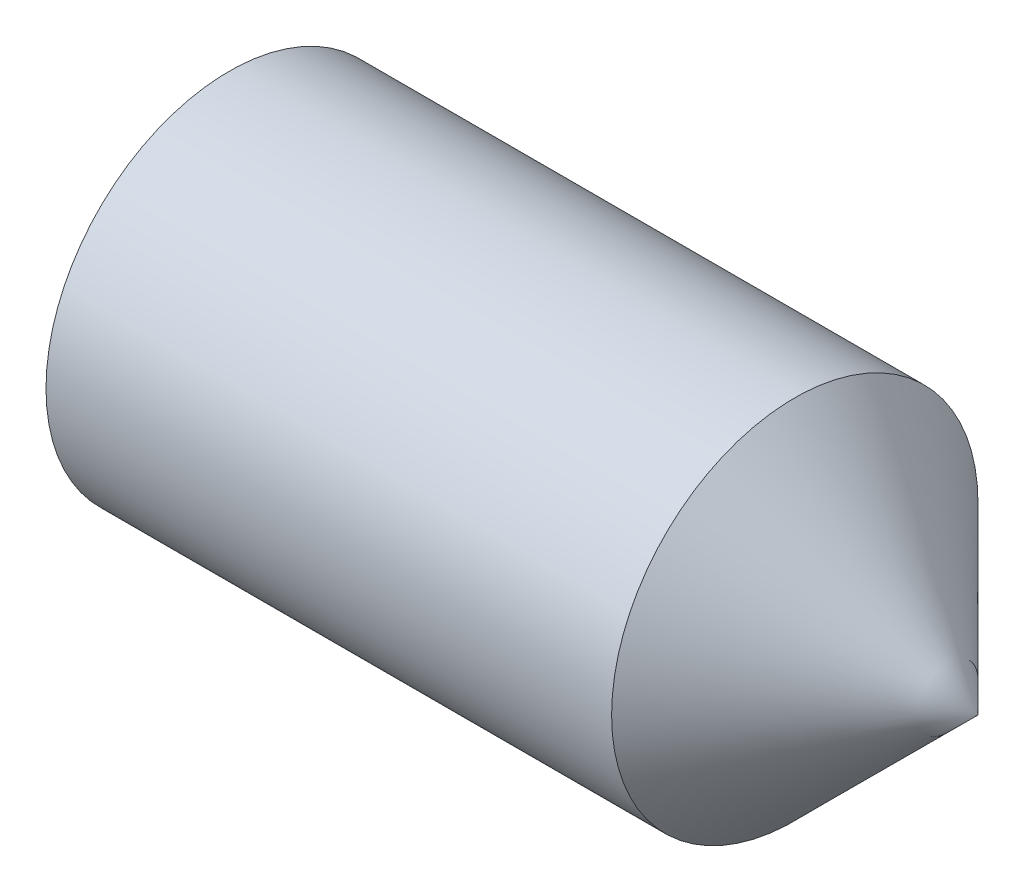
from build123d import *

# Parameters (mm, degrees)
HEX_2_DEPTH = 15


with BuildPart() as part:
    # BodySke → BaseBody (revolve)
    with BuildSketch(Plane.XY, mode=Mode.PRIVATE) as basebody_sk:
        Polygon((0, 0), (0, 10.352), (0.951473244, 12), (38, 12), (50, 0), align=None)
    revolve(basebody_sk.sketch.rotate(Axis((-12.7, 0, 0), (1, 0, 0)), 90), axis=Axis((-12.7, 0, 0), (1, 0, 0)))

    # Sketch2 → Hex 2 (cut)
    with BuildSketch(Plane.ZY):
        Polygon((3.464101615, 6), (-3.464101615, 6), (-6.92820323, 0), (-3.464101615, -6), (3.464101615, -6), (6.92820323, 0), align=None)
    extrude(amount=-HEX_2_DEPTH, mode=Mode.SUBTRACT)


solid = part.part
